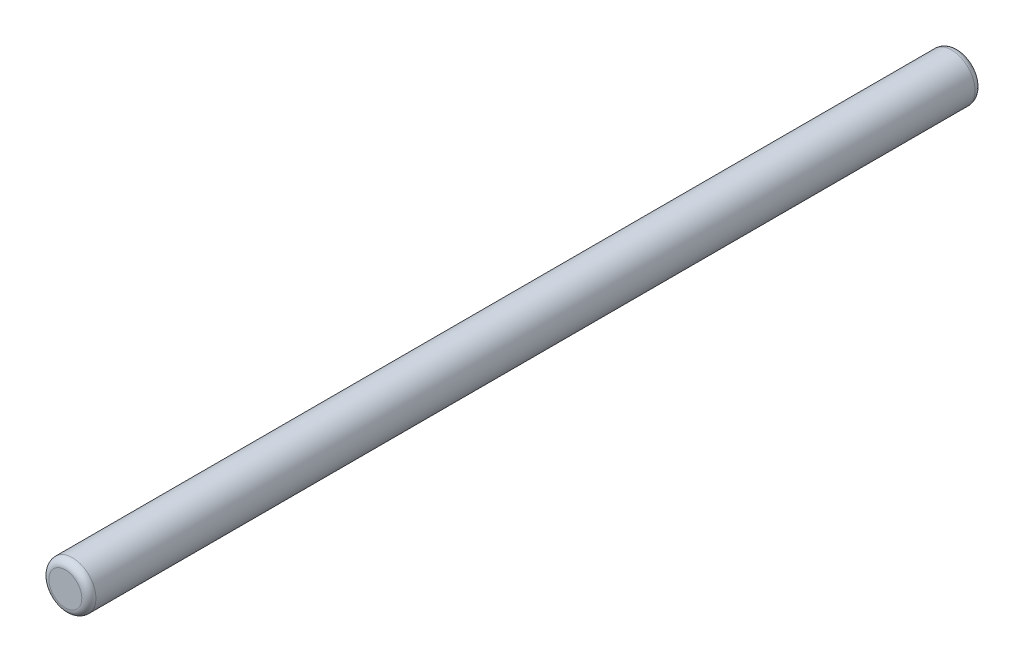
from build123d import *

# Parameters (mm, degrees)
ESQUISSE1_R          = 1
BASE_EXTRUSION_DEPTH = 38
CONG_1_R             = 0.3


with BuildPart() as part:
    # Esquisse1 → Base-Extrusion (new body)
    with BuildSketch(Plane.XY):
        Circle(ESQUISSE1_R)
    extrude(amount=BASE_EXTRUSION_DEPTH)

    # Cong_1
    cong_1_edges = [part.edges().sort_by_distance(p)[0] for p in [
        (-1, 0, 0),
        (-1, 0, 38),
    ]]
    fillet(cong_1_edges, radius=CONG_1_R)


solid = part.part
